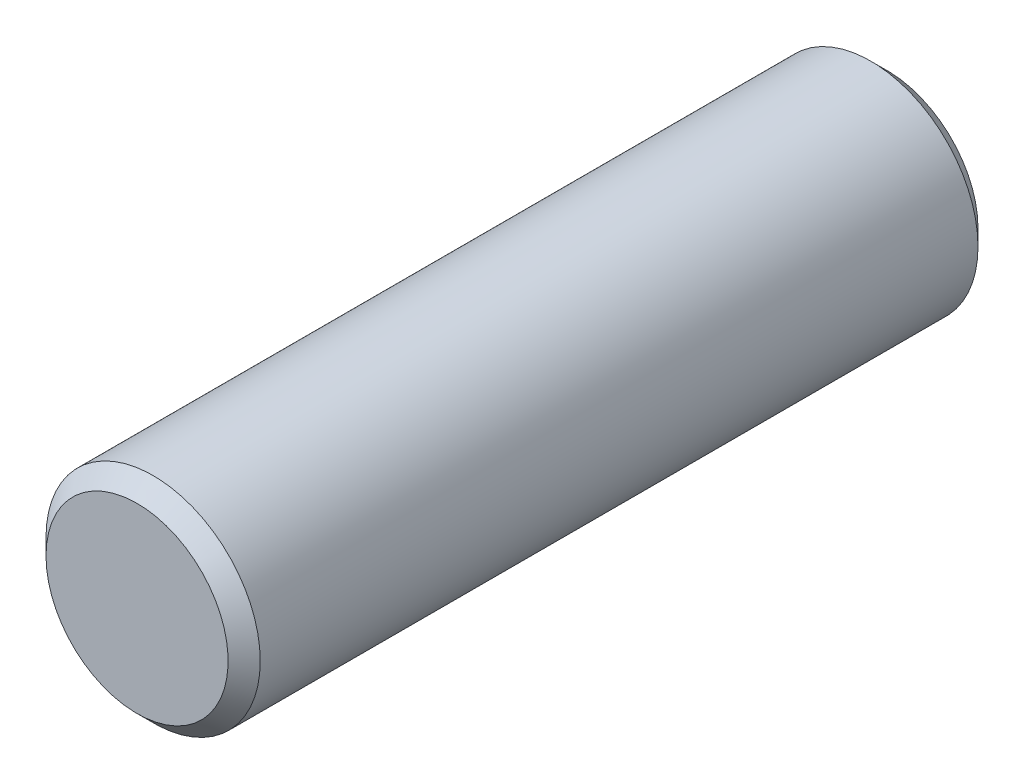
ISO-10303-21;
HEADER;
FILE_DESCRIPTION(('STEP AP214'),'2;1');
FILE_NAME('part.step','',(''),(''),'','','');
FILE_SCHEMA(('AUTOMOTIVE_DESIGN { 1 0 10303 214 1 1 1 1 }'));
ENDSEC;
DATA;
#1=APPLICATION_CONTEXT('core data for automotive mechanical design processes');
#2=APPLICATION_PROTOCOL_DEFINITION('international standard','automotive_design',2000,#1);
#3=PRODUCT_CONTEXT('',#1,'mechanical');
#4=PRODUCT('Part','Part','',(#3));
#5=PRODUCT_RELATED_PRODUCT_CATEGORY('part','',(#4));
#6=PRODUCT_DEFINITION_FORMATION('','',#4);
#7=PRODUCT_DEFINITION_CONTEXT('part definition',#1,'design');
#8=PRODUCT_DEFINITION('design','',#6,#7);
#9=PRODUCT_DEFINITION_SHAPE('','',#8);
#10=(LENGTH_UNIT() NAMED_UNIT(*) SI_UNIT(.MILLI.,.METRE.));
#11=(NAMED_UNIT(*) PLANE_ANGLE_UNIT() SI_UNIT($,.RADIAN.));
#12=(NAMED_UNIT(*) SI_UNIT($,.STERADIAN.) SOLID_ANGLE_UNIT());
#13=UNCERTAINTY_MEASURE_WITH_UNIT(LENGTH_MEASURE(1.E-05),#10,'distance_accuracy_value','');
#14=(GEOMETRIC_REPRESENTATION_CONTEXT(3) GLOBAL_UNCERTAINTY_ASSIGNED_CONTEXT((#13)) GLOBAL_UNIT_ASSIGNED_CONTEXT((#10,
#11,#12)) REPRESENTATION_CONTEXT('',''));
#15=CARTESIAN_POINT('',(0.,0.,0.));
#16=DIRECTION('',(0.,0.,1.));
#17=DIRECTION('',(1.,0.,0.));
#18=AXIS2_PLACEMENT_3D('',#15,#16,#17);
#19=CARTESIAN_POINT('',(0.,0.,14.));
#20=DIRECTION('',(0.,0.,-1.));
#21=DIRECTION('',(-1.,0.,0.));
#22=AXIS2_PLACEMENT_3D('',#19,#20,#21);
#23=PLANE('',#22);
#24=CARTESIAN_POINT('',(0.,0.,14.0000000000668));
#25=DIRECTION('',(0.,0.,-1.));
#26=DIRECTION('',(-1.,0.,0.));
#27=AXIS2_PLACEMENT_3D('',#24,#25,#26);
#28=CIRCLE('',#27,1.7000000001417);
#29=CARTESIAN_POINT('',(-1.7000000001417,0.,14.0000000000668));
#30=VERTEX_POINT('',#29);
#31=EDGE_CURVE('E18',#30,#30,#28,.T.);
#32=ORIENTED_EDGE('',*,*,#31,.F.);
#33=EDGE_LOOP('',(#32));
#34=FACE_BOUND('',#33,.T.);
#35=ADVANCED_FACE('F15',(#34),#23,.F.);
#36=CARTESIAN_POINT('',(0.,0.,0.));
#37=DIRECTION('',(0.,0.,-1.));
#38=DIRECTION('',(-1.,0.,0.));
#39=AXIS2_PLACEMENT_3D('',#36,#37,#38);
#40=PLANE('',#39);
#41=CARTESIAN_POINT('',(0.,0.,-1.13686837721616E-10));
#42=DIRECTION('',(0.,0.,1.));
#43=DIRECTION('',(1.,0.,0.));
#44=AXIS2_PLACEMENT_3D('',#41,#42,#43);
#45=CIRCLE('',#44,1.70000000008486);
#46=CARTESIAN_POINT('',(1.70000000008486,0.,-1.13686837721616E-10));
#47=VERTEX_POINT('',#46);
#48=EDGE_CURVE('E27',#47,#47,#45,.T.);
#49=ORIENTED_EDGE('',*,*,#48,.F.);
#50=EDGE_LOOP('',(#49));
#51=FACE_BOUND('',#50,.T.);
#52=ADVANCED_FACE('F42',(#51),#40,.T.);
#53=CARTESIAN_POINT('',(0.,0.,13.6999999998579));
#54=DIRECTION('',(0.,0.,-1.));
#55=DIRECTION('',(-1.,0.,0.));
#56=AXIS2_PLACEMENT_3D('',#53,#54,#55);
#57=CONICAL_SURFACE('',#56,1.99999999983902,0.785398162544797);
#58=CARTESIAN_POINT('',(0.,0.,13.7));
#59=DIRECTION('',(0.,0.,1.));
#60=DIRECTION('',(1.,0.,0.));
#61=AXIS2_PLACEMENT_3D('',#58,#59,#60);
#62=CIRCLE('',#61,2.);
#63=CARTESIAN_POINT('',(2.,0.,13.7));
#64=VERTEX_POINT('',#63);
#65=EDGE_CURVE('E22',#64,#64,#62,.F.);
#66=ORIENTED_EDGE('',*,*,#65,.F.);
#67=EDGE_LOOP('',(#66));
#68=FACE_BOUND('',#67,.T.);
#69=ORIENTED_EDGE('',*,*,#31,.T.);
#70=EDGE_LOOP('',(#69));
#71=FACE_BOUND('',#70,.T.);
#72=ADVANCED_FACE('F39',(#68,#71),#57,.T.);
#73=CARTESIAN_POINT('',(0.,0.,0.300000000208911));
#74=DIRECTION('',(0.,0.,1.));
#75=DIRECTION('',(1.,0.,0.));
#76=AXIS2_PLACEMENT_3D('',#73,#74,#75);
#77=CONICAL_SURFACE('',#76,1.99999999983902,0.785398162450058);
#78=ORIENTED_EDGE('',*,*,#48,.T.);
#79=EDGE_LOOP('',(#78));
#80=FACE_BOUND('',#79,.T.);
#81=CARTESIAN_POINT('',(0.,0.,0.3));
#82=DIRECTION('',(0.,0.,1.));
#83=DIRECTION('',(1.,0.,0.));
#84=AXIS2_PLACEMENT_3D('',#81,#82,#83);
#85=CIRCLE('',#84,2.);
#86=CARTESIAN_POINT('',(2.,0.,0.3));
#87=VERTEX_POINT('',#86);
#88=EDGE_CURVE('E10',#87,#87,#85,.T.);
#89=ORIENTED_EDGE('',*,*,#88,.F.);
#90=EDGE_LOOP('',(#89));
#91=FACE_BOUND('',#90,.T.);
#92=ADVANCED_FACE('F50',(#80,#91),#77,.T.);
#93=CARTESIAN_POINT('',(0.,0.,0.));
#94=DIRECTION('',(0.,0.,1.));
#95=DIRECTION('',(1.,0.,0.));
#96=AXIS2_PLACEMENT_3D('',#93,#94,#95);
#97=CYLINDRICAL_SURFACE('',#96,2.);
#98=ORIENTED_EDGE('',*,*,#88,.T.);
#99=EDGE_LOOP('',(#98));
#100=FACE_BOUND('',#99,.T.);
#101=ORIENTED_EDGE('',*,*,#65,.T.);
#102=EDGE_LOOP('',(#101));
#103=FACE_BOUND('',#102,.T.);
#104=ADVANCED_FACE('F48',(#100,#103),#97,.T.);
#105=CLOSED_SHELL('',(#35,#52,#72,#92,#104));
#106=MANIFOLD_SOLID_BREP('B1',#105);
#107=ADVANCED_BREP_SHAPE_REPRESENTATION('',(#18,#106),#14);
#108=SHAPE_DEFINITION_REPRESENTATION(#9,#107);
ENDSEC;
END-ISO-10303-21;
